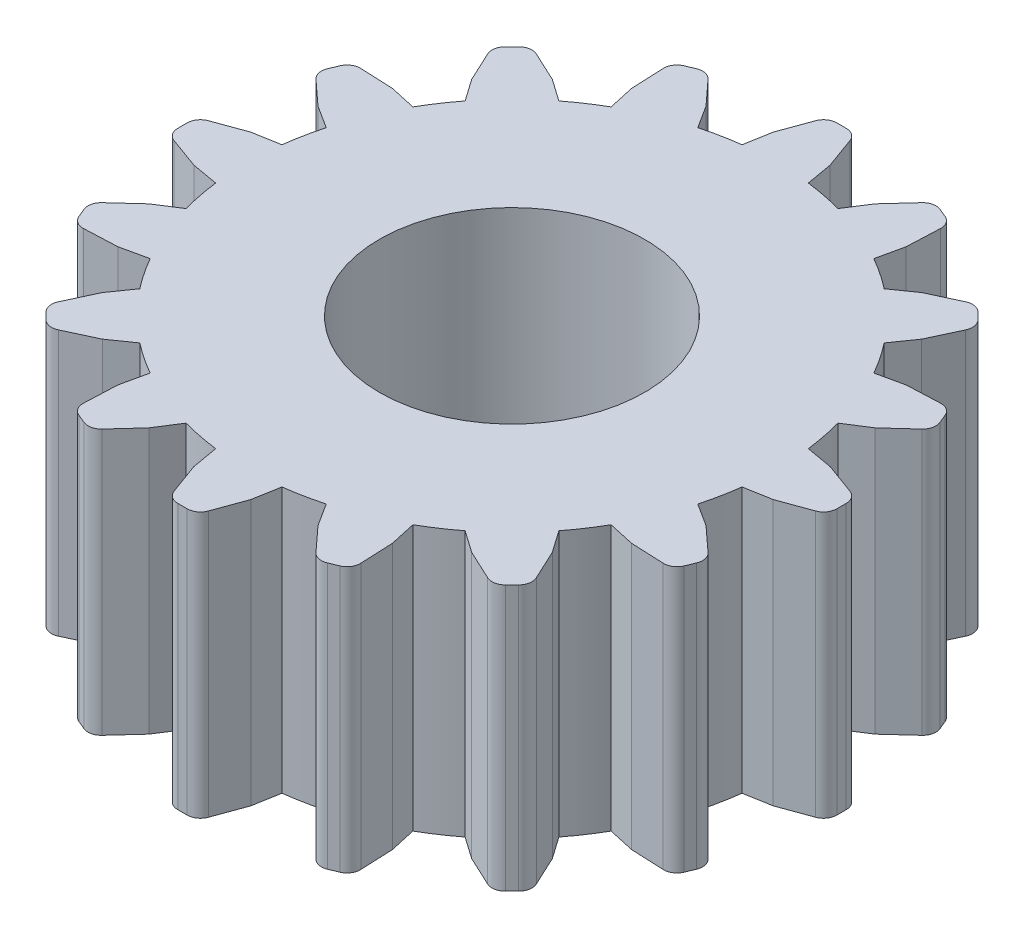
from build123d import *

# Parameters (mm, degrees)
SKETCH1_R                = 25.4
SKETCH1_R_2              = 12.7
BOSS_EXTRUDE1_DEPTH      = 25.4
BOSS_EXTRUDE2_DEPTH      = 25.4
FILLET1_R                = 1.27
CIRPATTERN1_COUNT        = 16
FILLET1_OF_CIRPATTERN1_R = 1.27


with BuildPart() as part:
    # Sketch1 → Boss-Extrude1 (new body)
    with BuildSketch(Plane(origin=(0, 0, 0), x_dir=(1, 0, 0), z_dir=(0, 1, 0))):
        with Locations(Location((0, 0, 0), (0, 0, 270))):
            Circle(SKETCH1_R)
        with Locations(Location((0, 0, 0), (0, 0, 270))):
            Circle(SKETCH1_R_2, mode=Mode.SUBTRACT)
    extrude(amount=BOSS_EXTRUDE1_DEPTH)

    # Sketch2 → Boss-Extrude2 (add)
    with BuildSketch(Plane(origin=(0, 25.4, 0), x_dir=(1, 0, 0), z_dir=(0, 1, 0))):
        Polygon((-3.175, 25.200781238), (3.175, 25.200781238), (2.727129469, 27.740781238), (1.340402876, 31.550781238), (-1.340402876, 31.550781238), (-2.727129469, 27.740781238), align=None)
    boss_extrude2 = extrude(amount=-BOSS_EXTRUDE2_DEPTH)

    # Fillet1
    fillet1_edges = [part.edges().sort_by_distance(p)[0] for p in [
        (-1.340402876, 12.7, -31.550781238),
        (1.340402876, 12.7, -31.550781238),
    ]]
    fillet(fillet1_edges, radius=FILLET1_R)

    # CirPattern1: Boss-Extrude2 ×16 about axis
    cirpattern1_axis = Axis((0, 0, 0), (0, 1, 0))
    for i in range(1, CIRPATTERN1_COUNT):
        add(boss_extrude2.rotate(cirpattern1_axis, i * 360 / CIRPATTERN1_COUNT))

    # Fillet1 of CirPattern1
    fillet1_of_cirpattern1_edges = [part.edges().sort_by_distance(p)[0] for p in [
        (-13.312332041, 12.7, -28.636171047),
        (-10.835590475, 12.7, -29.662070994),
        (-23.257579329, 12.7, -21.361963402),
        (-21.361963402, 12.7, -23.257579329),
        (-29.662070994, 12.7, -10.835590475),
        (-28.636171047, 12.7, -13.312332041),
        (-31.550781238, 12.7, 1.340402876),
        (-31.550781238, 12.7, -1.340402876),
        (-28.636171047, 12.7, 13.312332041),
        (-29.662070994, 12.7, 10.835590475),
        (-21.361963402, 12.7, 23.257579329),
        (-23.257579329, 12.7, 21.361963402),
        (-10.835590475, 12.7, 29.662070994),
        (-13.312332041, 12.7, 28.636171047),
        (1.340402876, 12.7, 31.550781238),
        (-1.340402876, 12.7, 31.550781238),
        (13.312332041, 12.7, 28.636171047),
        (10.835590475, 12.7, 29.662070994),
        (23.257579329, 12.7, 21.361963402),
        (21.361963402, 12.7, 23.257579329),
        (29.662070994, 12.7, 10.835590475),
        (28.636171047, 12.7, 13.312332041),
        (31.550781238, 12.7, -1.340402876),
        (31.550781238, 12.7, 1.340402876),
        (28.636171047, 12.7, -13.312332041),
        (29.662070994, 12.7, -10.835590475),
        (21.361963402, 12.7, -23.257579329),
        (23.257579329, 12.7, -21.361963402),
        (10.835590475, 12.7, -29.662070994),
        (13.312332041, 12.7, -28.636171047),
    ]]
    fillet(fillet1_of_cirpattern1_edges, radius=FILLET1_OF_CIRPATTERN1_R)


solid = part.part
